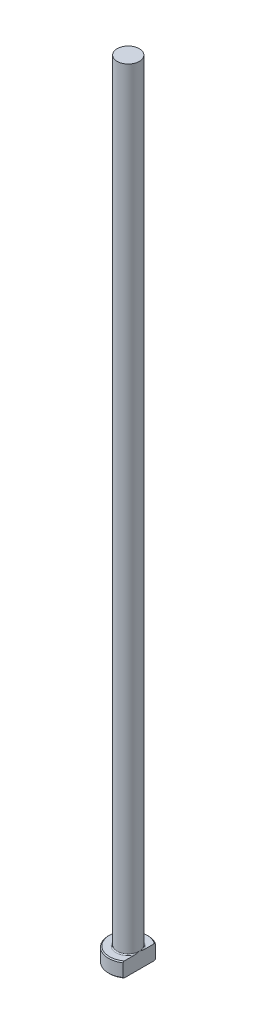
from build123d import *
from build123d.topology import SkipClean

# Parameters (mm, degrees)
CHAMFER1_SIZE = 0.2
FILLET1_R     = 0.2
KEY_DEPTH     = 161.09996877


with BuildPart() as part:
    # Sketch1 → Revolve1 (revolve)
    with BuildSketch(Plane.XY, mode=Mode.PRIVATE) as revolve1_sk:
        Polygon((0, 0), (-4, 0), (-4, 3), (-2.25, 3), (-2.25, 160), (0, 160), align=None)
    revolve(revolve1_sk.sketch.rotate(Axis((0, 259.958771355, 0), (0, -1, 0)), 270), axis=Axis((0, 259.958771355, 0), (0, -1, 0)))

    # Chamfer1
    chamfer1_edges = [part.edges().sort_by_distance(p)[0] for p in [
        (0, 3, -4),
        (0, 0, -4),
    ]]
    chamfer(chamfer1_edges, length=CHAMFER1_SIZE)

    # Fillet1
    fillet1_edges = [part.edges().sort_by_distance(p)[0] for p in [
        (0, 3, -2.25),
    ]]
    fillet(fillet1_edges, radius=FILLET1_R)

    # Sketch2 → KEY (cut, through all)
    with SkipClean():  # the faces are left unmerged after this step: merging them gives an invalid solid
        with BuildSketch(Plane(origin=(0, 0, 0), x_dir=(1, 0, 0), z_dir=(0, 1, 0))):
            with BuildLine():
                Line((2.25, 3.307189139), (2.25, -3.307189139))
                ThreePointArc((2.25, -3.307189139), (4, 0), (2.25, 3.307189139))
            make_face()
        extrude(amount=KEY_DEPTH, mode=Mode.SUBTRACT)


solid = part.part
